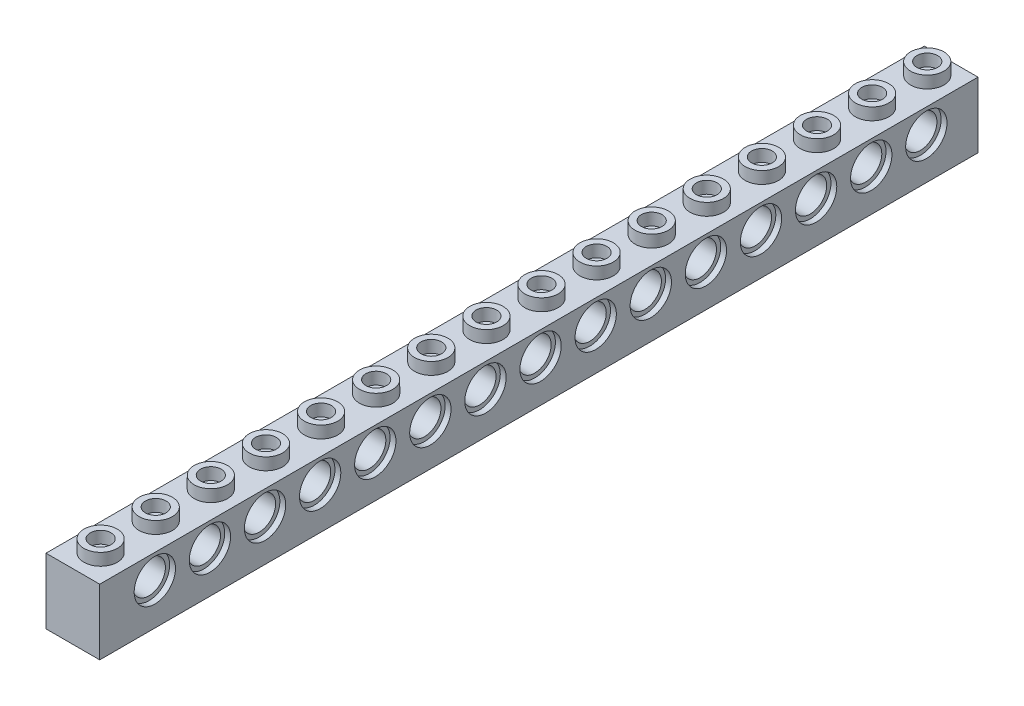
from build123d import *

# Parameters (mm, degrees)
SKETCH1_W           = 7.8
SKETCH1_H           = 9.52
BOSS_EXTRUDE1_DEPTH = 127.5
SKETCH2_R           = 2.425
SKETCH2_R_2         = 1.5
BOSS_EXTRUDE3_DEPTH = 1.75
LPATTERN1_COUNT     = 16
LPATTERN1_PITCH     = 8
SKETCH4_R           = 3
CUT_EXTRUDE1_DEPTH  = 0.85
CUT_EXTRUDE2_START  = -0.85
SKETCH5_R           = 3
CUT_EXTRUDE2_DEPTH  = 0.85
SKETCH6_R           = 2.385
CUT_EXTRUDE3_DEPTH  = 128.85512348
LPATTERN2_COUNT     = 15
LPATTERN2_PITCH     = 8
LPATTERN3_COUNT     = 15
LPATTERN3_PITCH     = 8
SKETCH10_W          = 4.9
SKETCH10_H          = 124.6
CUT_EXTRUDE4_DEPTH  = 3
BOSS_EXTRUDE8_REACH = 130.057
SKETCH11_R          = 1.5
LPATTERN4_COUNT     = 15
LPATTERN4_PITCH     = 8


with BuildPart() as part:
    # Sketch1 → Boss-Extrude1 (new body)
    with BuildSketch(Plane.XY):
        Rectangle(SKETCH1_W, SKETCH1_H)
    extrude(amount=BOSS_EXTRUDE1_DEPTH)

    # Sketch2 → Boss-Extrude3 (add)
    with BuildSketch(Plane(origin=(0, 4.76, 0), x_dir=(1, 0, 0), z_dir=(0, 1, 0))):
        with Locations((0, -3.47)):
            Circle(SKETCH2_R)
        with Locations(Location((0, -3.47, 0), (0, 0, 180))):
            Circle(SKETCH2_R_2, mode=Mode.SUBTRACT)
    boss_extrude3 = extrude(amount=BOSS_EXTRUDE3_DEPTH)

    # LPattern1: Boss-Extrude3 ×16
    with Locations(*[(0, 0, i * LPATTERN1_PITCH) for i in range(1, LPATTERN1_COUNT)]):
        add(boss_extrude3)

    # Sketch4 → Cut-Extrude1 (cut)
    with BuildSketch(Plane(origin=(3.9, 0, 0), x_dir=(0, 0, -1), z_dir=(1, 0, 0))):
        with Locations((-7.5, 1.26)):
            Circle(SKETCH4_R)
    cut_extrude1 = extrude(amount=-CUT_EXTRUDE1_DEPTH, mode=Mode.SUBTRACT)

    # Sketch5 → Cut-Extrude2 (cut)
    with BuildSketch(Plane.ZY.offset(3.9).offset(CUT_EXTRUDE2_START)):
        with Locations(Location((7.5, 1.26, 0), (0, 0, 180))):
            Circle(SKETCH5_R)
    cut_extrude2 = extrude(amount=CUT_EXTRUDE2_DEPTH, mode=Mode.SUBTRACT)

    # Sketch6 → Cut-Extrude3 (cut, through all)
    with BuildSketch(Plane(origin=(3.05, 0, 0), x_dir=(0, 0, -1), z_dir=(1, 0, 0))):
        with Locations((-7.5, 1.26)):
            Circle(SKETCH6_R)
    cut_extrude3 = extrude(amount=-CUT_EXTRUDE3_DEPTH, mode=Mode.SUBTRACT)

    # LPattern2: Cut-Extrude1, Cut-Extrude2 ×15
    with Locations(*[(0, 0, i * LPATTERN2_PITCH) for i in range(1, LPATTERN2_COUNT)]):
        add(cut_extrude1, mode=Mode.SUBTRACT)
        add(cut_extrude2, mode=Mode.SUBTRACT)

    # LPattern3: Cut-Extrude3 ×15
    with Locations(*[(0, 0, i * LPATTERN3_PITCH) for i in range(1, LPATTERN3_COUNT)]):
        add(cut_extrude3, mode=Mode.SUBTRACT)

    # Sketch10 → Cut-Extrude4 (cut)
    with BuildSketch(Plane.XZ.offset(4.76)):
        with Locations((0, 63.75)):
            Rectangle(SKETCH10_W, SKETCH10_H)
    extrude(amount=-CUT_EXTRUDE4_DEPTH, mode=Mode.SUBTRACT)

    # Sketch11 → Boss-Extrude8 (add, up to next)
    with BuildSketch(Plane.XZ.offset(4.76), mode=Mode.PRIVATE) as boss_extrude8_sk1:
        with Locations(Location((0, 119.5, 0), (0, 0, 270))):
            Circle(SKETCH11_R)
    boss_extrude8_tool1 = extrude(boss_extrude8_sk1.sketch, amount=-BOSS_EXTRUDE8_REACH, mode=Mode.PRIVATE) - part.part
    boss_extrude8 = boss_extrude8_tool1.solids().sort_by_distance((0, -4.76, 119.5))[0]
    add(boss_extrude8)

    # LPattern4: Boss-Extrude8 ×15
    with Locations(*[(0, 0, -i * LPATTERN4_PITCH) for i in range(1, LPATTERN4_COUNT)]):
        add(boss_extrude8)


solid = part.part
